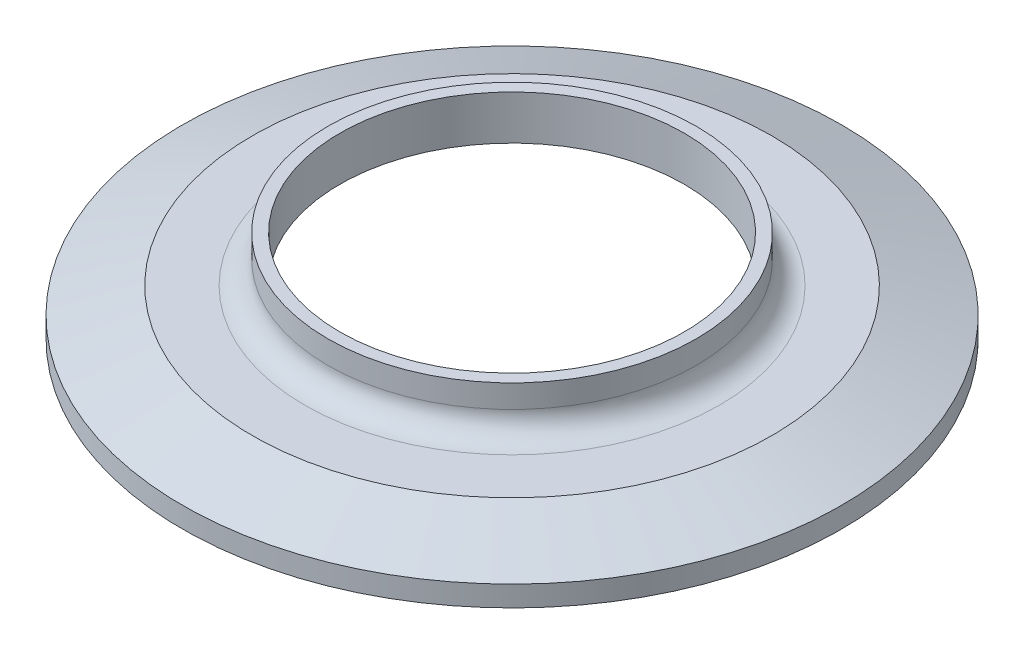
from build123d import *


with BuildPart() as part:
    # Sketch1 → Revolve1 (revolve)
    with BuildSketch(Plane.XY, mode=Mode.PRIVATE) as revolve1_sk:
        with BuildLine():
            Line((-25.4, 12.7), (-25.4, 9.525))
            ThreePointArc((-25.4, 9.525), (-26.32993597, 7.27993597), (-28.575, 6.35))
            Line((-28.575, 6.35), (-35.822842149, 6.35))
            Line((-35.822842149, 6.35), (-45.4533, 2.8448))
            Line((-45.4533, 2.8448), (-45.4533, 0))
            Line((-45.4533, 0), (-43.659272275, 0.002512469))
            ThreePointArc((-43.659272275, 0.002512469), (-43.224677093, 0.133310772), (-42.934466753, 0.482250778))
            Line((-42.934466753, 0.482250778), (-42.767598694, 0.87536729))
            ThreePointArc((-42.767598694, 0.87536729), (-41.6687, 1.602712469), (-40.569801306, 0.87536729))
            Line((-40.569801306, 0.87536729), (-40.402933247, 0.482250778))
            ThreePointArc((-40.402933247, 0.482250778), (-40.112722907, 0.133310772), (-39.678127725, 0.002512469))
            Line((-39.678127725, 0.002512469), (-36.449, 0))
            Line((-36.449, 0), (-23.749, 6.591493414))
            Line((-23.749, 6.591493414), (-23.749, 12.7))
            Line((-23.749, 12.7), (-25.4, 12.7))
        make_face()
    revolve(revolve1_sk.sketch.rotate(Axis((0, 0, 0), (0, 1, 0)), 270), axis=Axis((0, 0, 0), (0, 1, 0)))


solid = part.part
